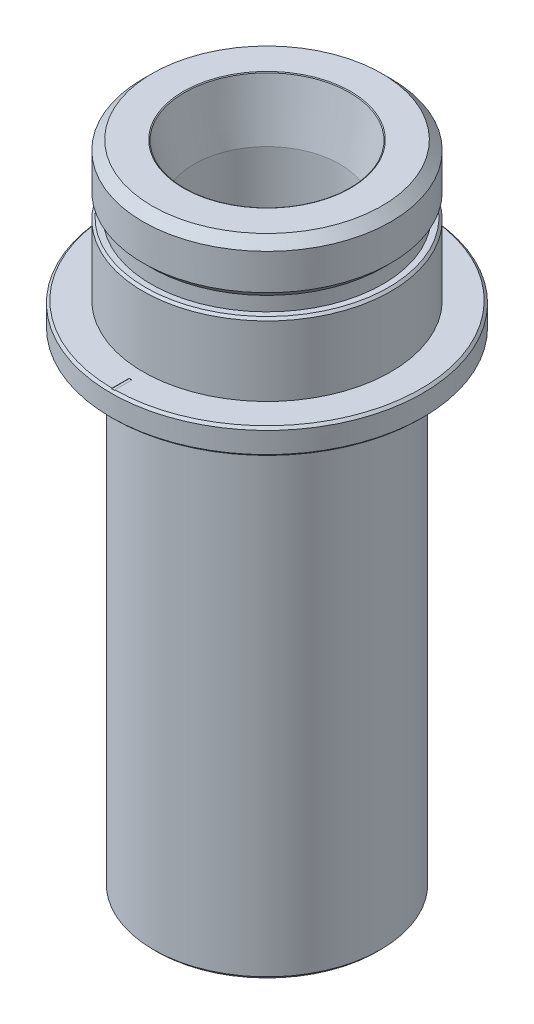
ISO-10303-21;
HEADER;
FILE_DESCRIPTION(('STEP AP214'),'2;1');
FILE_NAME('part.step','',(''),(''),'','','');
FILE_SCHEMA(('AUTOMOTIVE_DESIGN { 1 0 10303 214 1 1 1 1 }'));
ENDSEC;
DATA;
#1=APPLICATION_CONTEXT('core data for automotive mechanical design processes');
#2=APPLICATION_PROTOCOL_DEFINITION('international standard','automotive_design',2000,#1);
#3=PRODUCT_CONTEXT('',#1,'mechanical');
#4=PRODUCT('Part','Part','',(#3));
#5=PRODUCT_RELATED_PRODUCT_CATEGORY('part','',(#4));
#6=PRODUCT_DEFINITION_FORMATION('','',#4);
#7=PRODUCT_DEFINITION_CONTEXT('part definition',#1,'design');
#8=PRODUCT_DEFINITION('design','',#6,#7);
#9=PRODUCT_DEFINITION_SHAPE('','',#8);
#10=(LENGTH_UNIT() NAMED_UNIT(*) SI_UNIT(.MILLI.,.METRE.));
#11=(NAMED_UNIT(*) PLANE_ANGLE_UNIT() SI_UNIT($,.RADIAN.));
#12=(NAMED_UNIT(*) SI_UNIT($,.STERADIAN.) SOLID_ANGLE_UNIT());
#13=UNCERTAINTY_MEASURE_WITH_UNIT(LENGTH_MEASURE(1.E-05),#10,'distance_accuracy_value','');
#14=(GEOMETRIC_REPRESENTATION_CONTEXT(3) GLOBAL_UNCERTAINTY_ASSIGNED_CONTEXT((#13)) GLOBAL_UNIT_ASSIGNED_CONTEXT((#10,
#11,#12)) REPRESENTATION_CONTEXT('',''));
#15=CARTESIAN_POINT('',(0.,0.,0.));
#16=DIRECTION('',(0.,0.,1.));
#17=DIRECTION('',(1.,0.,0.));
#18=AXIS2_PLACEMENT_3D('',#15,#16,#17);
#19=CARTESIAN_POINT('',(-0.0234141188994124,80.5713399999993,-152.4));
#20=DIRECTION('',(0.,1.,0.));
#21=DIRECTION('',(0.,0.,1.));
#22=AXIS2_PLACEMENT_3D('',#19,#20,#21);
#23=CONICAL_SURFACE('',#22,27.6859999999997,0.785398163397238);
#24=CARTESIAN_POINT('',(-0.0234141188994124,80.5713399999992,-152.4));
#25=DIRECTION('',(0.,-1.,0.));
#26=DIRECTION('',(0.,0.,-1.));
#27=AXIS2_PLACEMENT_3D('',#24,#25,#26);
#28=CIRCLE('',#27,27.6859999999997);
#29=CARTESIAN_POINT('',(-0.0234141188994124,80.5713399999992,-180.086));
#30=VERTEX_POINT('',#29);
#31=EDGE_CURVE('E91',#30,#30,#28,.F.);
#32=ORIENTED_EDGE('',*,*,#31,.F.);
#33=EDGE_LOOP('',(#32));
#34=FACE_BOUND('',#33,.T.);
#35=CARTESIAN_POINT('',(-0.0234141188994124,78.7933399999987,-152.4));
#36=DIRECTION('',(0.,-1.,0.));
#37=DIRECTION('',(0.,0.,-1.));
#38=AXIS2_PLACEMENT_3D('',#35,#36,#37);
#39=CIRCLE('',#38,25.908);
#40=CARTESIAN_POINT('',(-0.0234141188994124,78.7933399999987,-178.308));
#41=VERTEX_POINT('',#40);
#42=EDGE_CURVE('E94',#41,#41,#39,.T.);
#43=ORIENTED_EDGE('',*,*,#42,.F.);
#44=EDGE_LOOP('',(#43));
#45=FACE_BOUND('',#44,.T.);
#46=ADVANCED_FACE('F17',(#34,#45),#23,.T.);
#47=CARTESIAN_POINT('',(-0.0234141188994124,77.2058399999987,-152.4));
#48=DIRECTION('',(0.,-1.,0.));
#49=DIRECTION('',(0.,0.,-1.));
#50=AXIS2_PLACEMENT_3D('',#47,#48,#49);
#51=CYLINDRICAL_SURFACE('',#50,25.908);
#52=ORIENTED_EDGE('',*,*,#42,.T.);
#53=EDGE_LOOP('',(#52));
#54=FACE_BOUND('',#53,.T.);
#55=CARTESIAN_POINT('',(-0.0234141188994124,75.6183399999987,-152.4));
#56=DIRECTION('',(0.,-1.,0.));
#57=DIRECTION('',(0.,0.,-1.));
#58=AXIS2_PLACEMENT_3D('',#55,#56,#57);
#59=CIRCLE('',#58,25.908);
#60=CARTESIAN_POINT('',(-0.0234141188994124,75.6183399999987,-178.308));
#61=VERTEX_POINT('',#60);
#62=EDGE_CURVE('E20',#61,#61,#59,.T.);
#63=ORIENTED_EDGE('',*,*,#62,.F.);
#64=EDGE_LOOP('',(#63));
#65=FACE_BOUND('',#64,.T.);
#66=ADVANCED_FACE('F137',(#54,#65),#51,.T.);
#67=CARTESIAN_POINT('',(-0.0234141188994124,84.5718399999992,-152.4));
#68=DIRECTION('',(0.,-1.,0.));
#69=DIRECTION('',(0.,0.,-1.));
#70=AXIS2_PLACEMENT_3D('',#67,#68,#69);
#71=CYLINDRICAL_SURFACE('',#70,27.6859999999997);
#72=CARTESIAN_POINT('',(-0.0234141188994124,88.5723399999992,-152.4));
#73=DIRECTION('',(0.,-1.,0.));
#74=DIRECTION('',(0.,0.,1.));
#75=AXIS2_PLACEMENT_3D('',#72,#73,#74);
#76=CIRCLE('',#75,27.6859999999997);
#77=CARTESIAN_POINT('',(-0.0234141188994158,88.5723399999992,-124.714));
#78=VERTEX_POINT('',#77);
#79=EDGE_CURVE('E61',#78,#78,#76,.F.);
#80=ORIENTED_EDGE('',*,*,#79,.F.);
#81=EDGE_LOOP('',(#80));
#82=FACE_BOUND('',#81,.T.);
#83=ORIENTED_EDGE('',*,*,#31,.T.);
#84=EDGE_LOOP('',(#83));
#85=FACE_BOUND('',#84,.T.);
#86=ADVANCED_FACE('F127',(#82,#85),#71,.T.);
#87=CARTESIAN_POINT('',(-0.0234141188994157,75.6183399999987,-125.222));
#88=DIRECTION('',(0.,1.,0.));
#89=DIRECTION('',(0.,0.,1.));
#90=AXIS2_PLACEMENT_3D('',#87,#88,#89);
#91=PLANE('',#90);
#92=ORIENTED_EDGE('',*,*,#62,.T.);
#93=EDGE_LOOP('',(#92));
#94=FACE_BOUND('',#93,.T.);
#95=CARTESIAN_POINT('',(-0.0234141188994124,75.6183399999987,-152.4));
#96=DIRECTION('',(0.,-1.,0.));
#97=DIRECTION('',(0.,0.,-1.));
#98=AXIS2_PLACEMENT_3D('',#95,#96,#97);
#99=CIRCLE('',#98,27.1779999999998);
#100=CARTESIAN_POINT('',(-0.0234141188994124,75.6183399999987,-179.578));
#101=VERTEX_POINT('',#100);
#102=EDGE_CURVE('E60',#101,#101,#99,.T.);
#103=ORIENTED_EDGE('',*,*,#102,.F.);
#104=EDGE_LOOP('',(#103));
#105=FACE_BOUND('',#104,.T.);
#106=ADVANCED_FACE('F124',(#94,#105),#91,.T.);
#107=CARTESIAN_POINT('',(-0.0234141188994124,88.5723399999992,-152.4));
#108=DIRECTION('',(0.,-1.,0.));
#109=DIRECTION('',(0.,0.,-1.));
#110=AXIS2_PLACEMENT_3D('',#107,#108,#109);
#111=CONICAL_SURFACE('',#110,27.6859999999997,0.785398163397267);
#112=CARTESIAN_POINT('',(-0.0234141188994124,90.6040707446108,-152.4));
#113=DIRECTION('',(0.,-1.,0.));
#114=DIRECTION('',(0.,0.,1.));
#115=AXIS2_PLACEMENT_3D('',#112,#113,#114);
#116=CIRCLE('',#115,25.654269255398);
#117=CARTESIAN_POINT('',(-0.0234141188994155,90.6040707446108,-126.745730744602));
#118=VERTEX_POINT('',#117);
#119=EDGE_CURVE('E67',#118,#118,#116,.F.);
#120=ORIENTED_EDGE('',*,*,#119,.F.);
#121=EDGE_LOOP('',(#120));
#122=FACE_BOUND('',#121,.T.);
#123=ORIENTED_EDGE('',*,*,#79,.T.);
#124=EDGE_LOOP('',(#123));
#125=FACE_BOUND('',#124,.T.);
#126=ADVANCED_FACE('F126',(#122,#125),#111,.T.);
#127=CARTESIAN_POINT('',(-0.0234141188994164,59.4512399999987,-119.822301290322));
#128=DIRECTION('',(0.,-1.,0.));
#129=DIRECTION('',(0.,0.,-1.));
#130=AXIS2_PLACEMENT_3D('',#127,#128,#129);
#131=PLANE('',#130);
#132=DIRECTION('',(0.,0.,-1.));
#133=VECTOR('',#132,1.);
#134=CARTESIAN_POINT('',(0.294085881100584,59.4512399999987,-121.92));
#135=LINE('',#134,#133);
#136=CARTESIAN_POINT('',(0.294085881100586,59.4512399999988,-118.00986559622));
#137=VERTEX_POINT('',#136);
#138=CARTESIAN_POINT('',(0.294085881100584,59.4512399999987,-121.92));
#139=VERTEX_POINT('',#138);
#140=EDGE_CURVE('E82',#137,#139,#135,.T.);
#141=ORIENTED_EDGE('',*,*,#140,.T.);
#142=DIRECTION('',(-1.,0.,0.));
#143=VECTOR('',#142,1.);
#144=CARTESIAN_POINT('',(-0.340914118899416,59.4512399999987,-121.92));
#145=LINE('',#144,#143);
#146=CARTESIAN_POINT('',(-0.340914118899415,59.4512399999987,-121.92));
#147=VERTEX_POINT('',#146);
#148=EDGE_CURVE('E53',#139,#147,#145,.T.);
#149=ORIENTED_EDGE('',*,*,#148,.T.);
#150=DIRECTION('',(0.,0.,1.));
#151=VECTOR('',#150,1.);
#152=CARTESIAN_POINT('',(-0.340914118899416,59.4512399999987,-117.724602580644));
#153=LINE('',#152,#151);
#154=CARTESIAN_POINT('',(-0.34091411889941,59.4512399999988,-118.00986559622));
#155=VERTEX_POINT('',#154);
#156=EDGE_CURVE('E62',#147,#155,#153,.T.);
#157=ORIENTED_EDGE('',*,*,#156,.T.);
#158=CARTESIAN_POINT('',(-0.0234141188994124,59.4512399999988,-152.4));
#159=DIRECTION('',(0.,-1.,0.));
#160=DIRECTION('',(0.,0.,-1.));
#161=AXIS2_PLACEMENT_3D('',#158,#159,#160);
#162=CIRCLE('',#161,34.3916000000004);
#163=EDGE_CURVE('E48',#137,#155,#162,.T.);
#164=ORIENTED_EDGE('',*,*,#163,.F.);
#165=EDGE_LOOP('',(#141,#149,#157,#164));
#166=FACE_BOUND('',#165,.T.);
#167=ADVANCED_FACE('F63',(#166),#131,.F.);
#168=CARTESIAN_POINT('',(-0.0234141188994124,75.1103399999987,-152.4));
#169=DIRECTION('',(0.,-1.,0.));
#170=DIRECTION('',(0.,0.,-1.));
#171=AXIS2_PLACEMENT_3D('',#168,#169,#170);
#172=CONICAL_SURFACE('',#171,27.6859999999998,0.785398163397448);
#173=ORIENTED_EDGE('',*,*,#102,.T.);
#174=EDGE_LOOP('',(#173));
#175=FACE_BOUND('',#174,.T.);
#176=CARTESIAN_POINT('',(-0.0234141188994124,75.1103399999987,-152.4));
#177=DIRECTION('',(0.,-1.,0.));
#178=DIRECTION('',(0.,0.,-1.));
#179=AXIS2_PLACEMENT_3D('',#176,#177,#178);
#180=CIRCLE('',#179,27.6859999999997);
#181=CARTESIAN_POINT('',(-0.0234141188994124,75.1103399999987,-180.086));
#182=VERTEX_POINT('',#181);
#183=EDGE_CURVE('E366',#182,#182,#180,.T.);
#184=ORIENTED_EDGE('',*,*,#183,.F.);
#185=EDGE_LOOP('',(#184));
#186=FACE_BOUND('',#185,.T.);
#187=ADVANCED_FACE('F121',(#175,#186),#172,.T.);
#188=CARTESIAN_POINT('',(-0.0234141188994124,90.6040707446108,-152.4));
#189=DIRECTION('',(0.,-1.,0.));
#190=DIRECTION('',(0.,0.,-1.));
#191=AXIS2_PLACEMENT_3D('',#188,#189,#190);
#192=CONICAL_SURFACE('',#191,25.654269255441,1.57075620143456);
#193=CARTESIAN_POINT('',(-0.0234141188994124,90.604349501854,-152.4));
#194=DIRECTION('',(0.,1.,0.));
#195=DIRECTION('',(0.,0.,1.));
#196=AXIS2_PLACEMENT_3D('',#193,#194,#195);
#197=CIRCLE('',#196,18.7071108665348);
#198=CARTESIAN_POINT('',(-0.0234141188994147,90.604349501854,-133.692889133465));
#199=VERTEX_POINT('',#198);
#200=EDGE_CURVE('E362',#199,#199,#197,.F.);
#201=ORIENTED_EDGE('',*,*,#200,.T.);
#202=EDGE_LOOP('',(#201));
#203=FACE_BOUND('',#202,.T.);
#204=ORIENTED_EDGE('',*,*,#119,.T.);
#205=EDGE_LOOP('',(#204));
#206=FACE_BOUND('',#205,.T.);
#207=ADVANCED_FACE('F201',(#203,#206),#192,.T.);
#208=CARTESIAN_POINT('',(-0.340914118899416,59.5274399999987,-117.724602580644));
#209=DIRECTION('',(-1.,0.,0.));
#210=DIRECTION('',(0.,0.,1.));
#211=AXIS2_PLACEMENT_3D('',#208,#209,#210);
#212=PLANE('',#211);
#213=ORIENTED_EDGE('',*,*,#156,.F.);
#214=DIRECTION('',(0.,1.,0.));
#215=VECTOR('',#214,1.);
#216=CARTESIAN_POINT('',(-0.340914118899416,59.5274399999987,-121.92));
#217=LINE('',#216,#215);
#218=CARTESIAN_POINT('',(-0.340914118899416,59.5274399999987,-121.92));
#219=VERTEX_POINT('',#218);
#220=EDGE_CURVE('E74',#147,#219,#217,.T.);
#221=ORIENTED_EDGE('',*,*,#220,.T.);
#222=DIRECTION('',(0.,0.,1.));
#223=VECTOR('',#222,1.);
#224=CARTESIAN_POINT('',(-0.340914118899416,59.5274399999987,-118.084599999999));
#225=LINE('',#224,#223);
#226=CARTESIAN_POINT('',(-0.340914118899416,59.5274399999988,-118.086068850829));
#227=VERTEX_POINT('',#226);
#228=EDGE_CURVE('E71',#227,#219,#225,.F.);
#229=ORIENTED_EDGE('',*,*,#228,.F.);
#230=DIRECTION('',(0.,0.707091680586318,-0.707121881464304));
#231=VECTOR('',#230,1.);
#232=CARTESIAN_POINT('',(-0.340914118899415,59.4512399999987,-118.00986559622));
#233=LINE('',#232,#231);
#234=EDGE_CURVE('E35',#155,#227,#233,.T.);
#235=ORIENTED_EDGE('',*,*,#234,.F.);
#236=EDGE_LOOP('',(#213,#221,#229,#235));
#237=FACE_BOUND('',#236,.T.);
#238=ADVANCED_FACE('F69',(#237),#212,.F.);
#239=CARTESIAN_POINT('',(-0.340914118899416,59.5274399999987,-121.92));
#240=DIRECTION('',(0.,0.,-1.));
#241=DIRECTION('',(-1.,0.,0.));
#242=AXIS2_PLACEMENT_3D('',#239,#240,#241);
#243=PLANE('',#242);
#244=ORIENTED_EDGE('',*,*,#220,.F.);
#245=ORIENTED_EDGE('',*,*,#148,.F.);
#246=DIRECTION('',(0.,1.,0.));
#247=VECTOR('',#246,1.);
#248=CARTESIAN_POINT('',(0.294085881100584,59.5274399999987,-121.92));
#249=LINE('',#248,#247);
#250=CARTESIAN_POINT('',(0.294085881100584,59.5274399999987,-121.92));
#251=VERTEX_POINT('',#250);
#252=EDGE_CURVE('E84',#139,#251,#249,.T.);
#253=ORIENTED_EDGE('',*,*,#252,.T.);
#254=DIRECTION('',(1.,0.,0.));
#255=VECTOR('',#254,1.);
#256=CARTESIAN_POINT('',(-0.0234141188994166,59.5274399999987,-121.92));
#257=LINE('',#256,#255);
#258=EDGE_CURVE('E368',#219,#251,#257,.T.);
#259=ORIENTED_EDGE('',*,*,#258,.F.);
#260=EDGE_LOOP('',(#244,#245,#253,#259));
#261=FACE_BOUND('',#260,.T.);
#262=ADVANCED_FACE('F194',(#261),#243,.F.);
#263=CARTESIAN_POINT('',(0.294085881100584,59.5274399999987,-121.92));
#264=DIRECTION('',(1.,0.,0.));
#265=DIRECTION('',(0.,0.,-1.));
#266=AXIS2_PLACEMENT_3D('',#263,#264,#265);
#267=PLANE('',#266);
#268=DIRECTION('',(0.,0.,1.));
#269=VECTOR('',#268,1.);
#270=CARTESIAN_POINT('',(0.294085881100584,59.5274399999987,-118.084599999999));
#271=LINE('',#270,#269);
#272=CARTESIAN_POINT('',(0.294085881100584,59.5274399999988,-118.08606885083));
#273=VERTEX_POINT('',#272);
#274=EDGE_CURVE('E117',#251,#273,#271,.T.);
#275=ORIENTED_EDGE('',*,*,#274,.F.);
#276=ORIENTED_EDGE('',*,*,#252,.F.);
#277=ORIENTED_EDGE('',*,*,#140,.F.);
#278=DIRECTION('',(0.,-0.707091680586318,0.707121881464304));
#279=VECTOR('',#278,1.);
#280=CARTESIAN_POINT('',(0.294085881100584,59.5274399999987,-118.086068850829));
#281=LINE('',#280,#279);
#282=EDGE_CURVE('E58',#273,#137,#281,.T.);
#283=ORIENTED_EDGE('',*,*,#282,.F.);
#284=EDGE_LOOP('',(#275,#276,#277,#283));
#285=FACE_BOUND('',#284,.T.);
#286=ADVANCED_FACE('F190',(#285),#267,.F.);
#287=CARTESIAN_POINT('',(-0.0234141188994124,67.3188899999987,-152.4));
#288=DIRECTION('',(0.,-1.,0.));
#289=DIRECTION('',(0.,0.,-1.));
#290=AXIS2_PLACEMENT_3D('',#287,#288,#289);
#291=CYLINDRICAL_SURFACE('',#290,27.6859999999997);
#292=ORIENTED_EDGE('',*,*,#183,.T.);
#293=EDGE_LOOP('',(#292));
#294=FACE_BOUND('',#293,.T.);
#295=CARTESIAN_POINT('',(-0.0234141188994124,59.5274399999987,-152.4));
#296=DIRECTION('',(0.,-1.,0.));
#297=DIRECTION('',(0.,0.,-1.));
#298=AXIS2_PLACEMENT_3D('',#295,#296,#297);
#299=CIRCLE('',#298,27.6859999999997);
#300=CARTESIAN_POINT('',(-0.0234141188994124,59.5274399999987,-180.086));
#301=VERTEX_POINT('',#300);
#302=EDGE_CURVE('E114',#301,#301,#299,.T.);
#303=ORIENTED_EDGE('',*,*,#302,.F.);
#304=EDGE_LOOP('',(#303));
#305=FACE_BOUND('',#304,.T.);
#306=ADVANCED_FACE('F186',(#294,#305),#291,.T.);
#307=CARTESIAN_POINT('',(-0.0234141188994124,90.604349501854,-152.4));
#308=DIRECTION('',(0.,1.,0.));
#309=DIRECTION('',(0.,0.,1.));
#310=AXIS2_PLACEMENT_3D('',#307,#308,#309);
#311=CONICAL_SURFACE('',#310,18.7071108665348,1.04719755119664);
#312=ORIENTED_EDGE('',*,*,#200,.F.);
#313=EDGE_LOOP('',(#312));
#314=FACE_BOUND('',#313,.T.);
#315=CARTESIAN_POINT('',(-0.0234141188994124,90.4818953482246,-152.4));
#316=DIRECTION('',(0.,1.,0.));
#317=DIRECTION('',(0.,0.,1.));
#318=AXIS2_PLACEMENT_3D('',#315,#316,#317);
#319=CIRCLE('',#318,18.4950140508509);
#320=CARTESIAN_POINT('',(-0.0234141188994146,90.4818953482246,-133.904985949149));
#321=VERTEX_POINT('',#320);
#322=EDGE_CURVE('E113',#321,#321,#319,.F.);
#323=ORIENTED_EDGE('',*,*,#322,.T.);
#324=EDGE_LOOP('',(#323));
#325=FACE_BOUND('',#324,.T.);
#326=ADVANCED_FACE('F182',(#314,#325),#311,.F.);
#327=CARTESIAN_POINT('',(-0.0234141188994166,59.5274399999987,-118.084599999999));
#328=DIRECTION('',(0.,1.,0.));
#329=DIRECTION('',(0.,0.,1.));
#330=AXIS2_PLACEMENT_3D('',#327,#328,#329);
#331=PLANE('',#330);
#332=ORIENTED_EDGE('',*,*,#302,.T.);
#333=EDGE_LOOP('',(#332));
#334=FACE_BOUND('',#333,.T.);
#335=ORIENTED_EDGE('',*,*,#274,.T.);
#336=CARTESIAN_POINT('',(-0.0234141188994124,59.5274399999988,-152.4));
#337=DIRECTION('',(0.,-1.,0.));
#338=DIRECTION('',(0.,0.,-1.));
#339=AXIS2_PLACEMENT_3D('',#336,#337,#338);
#340=CIRCLE('',#339,34.3154000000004);
#341=EDGE_CURVE('E110',#227,#273,#340,.T.);
#342=ORIENTED_EDGE('',*,*,#341,.F.);
#343=ORIENTED_EDGE('',*,*,#228,.T.);
#344=ORIENTED_EDGE('',*,*,#258,.T.);
#345=EDGE_LOOP('',(#335,#342,#343,#344));
#346=FACE_BOUND('',#345,.T.);
#347=ADVANCED_FACE('F178',(#334,#346),#331,.T.);
#348=CARTESIAN_POINT('',(-0.0234141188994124,90.4818953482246,-152.4));
#349=DIRECTION('',(0.,1.,0.));
#350=DIRECTION('',(-1.,0.,0.));
#351=AXIS2_PLACEMENT_3D('',#348,#349,#350);
#352=CONICAL_SURFACE('',#351,18.4950140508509,0.174560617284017);
#353=ORIENTED_EDGE('',*,*,#322,.F.);
#354=EDGE_LOOP('',(#353));
#355=FACE_BOUND('',#354,.T.);
#356=CARTESIAN_POINT('',(-0.0234141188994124,77.7858715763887,-152.4));
#357=DIRECTION('',(0.,-1.,0.));
#358=DIRECTION('',(0.,0.,-1.));
#359=AXIS2_PLACEMENT_3D('',#356,#357,#358);
#360=CIRCLE('',#359,16.256);
#361=CARTESIAN_POINT('',(-0.0234141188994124,77.7858715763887,-168.656));
#362=VERTEX_POINT('',#361);
#363=EDGE_CURVE('E112',#362,#362,#360,.T.);
#364=ORIENTED_EDGE('',*,*,#363,.T.);
#365=EDGE_LOOP('',(#364));
#366=FACE_BOUND('',#365,.T.);
#367=ADVANCED_FACE('F175',(#355,#366),#352,.F.);
#368=CARTESIAN_POINT('',(-0.0234141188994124,58.9940399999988,-152.4));
#369=DIRECTION('',(0.,-1.,0.));
#370=DIRECTION('',(0.,0.,-1.));
#371=AXIS2_PLACEMENT_3D('',#368,#369,#370);
#372=CONICAL_SURFACE('',#371,34.8488000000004,0.785398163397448);
#373=ORIENTED_EDGE('',*,*,#341,.T.);
#374=ORIENTED_EDGE('',*,*,#282,.T.);
#375=ORIENTED_EDGE('',*,*,#163,.T.);
#376=ORIENTED_EDGE('',*,*,#234,.T.);
#377=EDGE_LOOP('',(#373,#374,#375,#376));
#378=FACE_BOUND('',#377,.T.);
#379=CARTESIAN_POINT('',(-0.0234141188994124,58.9940399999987,-152.4));
#380=DIRECTION('',(0.,-1.,0.));
#381=DIRECTION('',(0.,0.,-1.));
#382=AXIS2_PLACEMENT_3D('',#379,#380,#381);
#383=CIRCLE('',#382,34.8488000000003);
#384=CARTESIAN_POINT('',(-0.0234141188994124,58.9940399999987,-187.2488));
#385=VERTEX_POINT('',#384);
#386=EDGE_CURVE('E109',#385,#385,#383,.T.);
#387=ORIENTED_EDGE('',*,*,#386,.F.);
#388=EDGE_LOOP('',(#387));
#389=FACE_BOUND('',#388,.T.);
#390=ADVANCED_FACE('F55',(#378,#389),#372,.T.);
#391=CARTESIAN_POINT('',(-0.0234141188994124,11.8051057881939,-152.4));
#392=DIRECTION('',(0.,-1.,0.));
#393=DIRECTION('',(0.,0.,-1.));
#394=AXIS2_PLACEMENT_3D('',#391,#392,#393);
#395=CYLINDRICAL_SURFACE('',#394,16.256);
#396=ORIENTED_EDGE('',*,*,#363,.F.);
#397=EDGE_LOOP('',(#396));
#398=FACE_BOUND('',#397,.T.);
#399=CARTESIAN_POINT('',(-0.0234141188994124,-54.175660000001,-152.4));
#400=DIRECTION('',(0.,-1.,0.));
#401=DIRECTION('',(0.,0.,-1.));
#402=AXIS2_PLACEMENT_3D('',#399,#400,#401);
#403=CIRCLE('',#402,16.256);
#404=CARTESIAN_POINT('',(-0.0234141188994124,-54.175660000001,-168.656));
#405=VERTEX_POINT('',#404);
#406=EDGE_CURVE('E106',#405,#405,#403,.F.);
#407=ORIENTED_EDGE('',*,*,#406,.F.);
#408=EDGE_LOOP('',(#407));
#409=FACE_BOUND('',#408,.T.);
#410=ADVANCED_FACE('F168',(#398,#409),#395,.F.);
#411=CARTESIAN_POINT('',(-0.0234141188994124,56.6539715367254,-152.4));
#412=DIRECTION('',(0.,-1.,0.));
#413=DIRECTION('',(0.,0.,-1.));
#414=AXIS2_PLACEMENT_3D('',#411,#412,#413);
#415=CYLINDRICAL_SURFACE('',#414,34.8488000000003);
#416=ORIENTED_EDGE('',*,*,#386,.T.);
#417=EDGE_LOOP('',(#416));
#418=FACE_BOUND('',#417,.T.);
#419=CARTESIAN_POINT('',(-0.0234141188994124,54.3139030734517,-152.4));
#420=DIRECTION('',(0.,1.,0.));
#421=DIRECTION('',(0.,0.,1.));
#422=AXIS2_PLACEMENT_3D('',#419,#420,#421);
#423=CIRCLE('',#422,34.8488000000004);
#424=CARTESIAN_POINT('',(-0.0234141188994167,54.3139030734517,-117.5512));
#425=VERTEX_POINT('',#424);
#426=EDGE_CURVE('E105',#425,#425,#423,.F.);
#427=ORIENTED_EDGE('',*,*,#426,.F.);
#428=EDGE_LOOP('',(#427));
#429=FACE_BOUND('',#428,.T.);
#430=ADVANCED_FACE('F164',(#418,#429),#415,.T.);
#431=CARTESIAN_POINT('',(-0.0234141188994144,-54.175660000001,-136.144));
#432=DIRECTION('',(0.,-1.,0.));
#433=DIRECTION('',(0.,0.,-1.));
#434=AXIS2_PLACEMENT_3D('',#431,#432,#433);
#435=PLANE('',#434);
#436=ORIENTED_EDGE('',*,*,#406,.T.);
#437=EDGE_LOOP('',(#436));
#438=FACE_BOUND('',#437,.T.);
#439=CARTESIAN_POINT('',(-0.0234141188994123,-54.1756600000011,-152.4));
#440=DIRECTION('',(0.,1.,0.));
#441=DIRECTION('',(-1.,0.,0.));
#442=AXIS2_PLACEMENT_3D('',#439,#440,#441);
#443=CIRCLE('',#442,24.6380000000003);
#444=CARTESIAN_POINT('',(-24.6614141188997,-54.1756600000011,-152.4));
#445=VERTEX_POINT('',#444);
#446=EDGE_CURVE('E102',#445,#445,#443,.T.);
#447=ORIENTED_EDGE('',*,*,#446,.F.);
#448=EDGE_LOOP('',(#447));
#449=FACE_BOUND('',#448,.T.);
#450=ADVANCED_FACE('F160',(#438,#449),#435,.T.);
#451=CARTESIAN_POINT('',(-0.0234141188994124,54.3139030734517,-152.4));
#452=DIRECTION('',(0.,1.,0.));
#453=DIRECTION('',(0.,0.,1.));
#454=AXIS2_PLACEMENT_3D('',#451,#452,#453);
#455=CONICAL_SURFACE('',#454,34.8488000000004,0.785398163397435);
#456=ORIENTED_EDGE('',*,*,#426,.T.);
#457=EDGE_LOOP('',(#456));
#458=FACE_BOUND('',#457,.T.);
#459=CARTESIAN_POINT('',(-0.0234141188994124,53.774339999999,-152.4));
#460=DIRECTION('',(0.,1.,0.));
#461=DIRECTION('',(0.,0.,1.));
#462=AXIS2_PLACEMENT_3D('',#459,#460,#461);
#463=CIRCLE('',#462,34.3092369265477);
#464=CARTESIAN_POINT('',(-0.0234141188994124,53.774339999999,-118.090763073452));
#465=VERTEX_POINT('',#464);
#466=EDGE_CURVE('E99',#465,#465,#463,.F.);
#467=ORIENTED_EDGE('',*,*,#466,.F.);
#468=EDGE_LOOP('',(#467));
#469=FACE_BOUND('',#468,.T.);
#470=ADVANCED_FACE('F156',(#458,#469),#455,.T.);
#471=CARTESIAN_POINT('',(-0.0234141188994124,-53.4136600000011,-152.4));
#472=DIRECTION('',(0.,1.,0.));
#473=DIRECTION('',(-1.,0.,0.));
#474=AXIS2_PLACEMENT_3D('',#471,#472,#473);
#475=CONICAL_SURFACE('',#474,25.4000000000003,0.785398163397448);
#476=CARTESIAN_POINT('',(-0.0234141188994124,-53.413660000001,-152.4));
#477=DIRECTION('',(0.,-1.,0.));
#478=DIRECTION('',(0.,0.,-1.));
#479=AXIS2_PLACEMENT_3D('',#476,#477,#478);
#480=CIRCLE('',#479,25.4000000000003);
#481=CARTESIAN_POINT('',(-0.0234141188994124,-53.413660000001,-177.8));
#482=VERTEX_POINT('',#481);
#483=EDGE_CURVE('E26',#482,#482,#480,.F.);
#484=ORIENTED_EDGE('',*,*,#483,.F.);
#485=EDGE_LOOP('',(#484));
#486=FACE_BOUND('',#485,.T.);
#487=ORIENTED_EDGE('',*,*,#446,.T.);
#488=EDGE_LOOP('',(#487));
#489=FACE_BOUND('',#488,.T.);
#490=ADVANCED_FACE('F149',(#486,#489),#475,.T.);
#491=CARTESIAN_POINT('',(-0.0234141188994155,53.774339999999,-126.999999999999));
#492=DIRECTION('',(0.,-1.,0.));
#493=DIRECTION('',(0.,0.,-1.));
#494=AXIS2_PLACEMENT_3D('',#491,#492,#493);
#495=PLANE('',#494);
#496=CARTESIAN_POINT('',(-0.0234141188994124,53.774339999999,-152.4));
#497=DIRECTION('',(0.,-1.,0.));
#498=DIRECTION('',(0.,0.,-1.));
#499=AXIS2_PLACEMENT_3D('',#496,#497,#498);
#500=CIRCLE('',#499,25.4000000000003);
#501=CARTESIAN_POINT('',(-0.0234141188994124,53.774339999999,-177.8));
#502=VERTEX_POINT('',#501);
#503=EDGE_CURVE('E11',#502,#502,#500,.T.);
#504=ORIENTED_EDGE('',*,*,#503,.F.);
#505=EDGE_LOOP('',(#504));
#506=FACE_BOUND('',#505,.T.);
#507=ORIENTED_EDGE('',*,*,#466,.T.);
#508=EDGE_LOOP('',(#507));
#509=FACE_BOUND('',#508,.T.);
#510=ADVANCED_FACE('F143',(#506,#509),#495,.T.);
#511=CARTESIAN_POINT('',(-0.0234141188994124,0.180339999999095,-152.4));
#512=DIRECTION('',(0.,-1.,0.));
#513=DIRECTION('',(0.,0.,-1.));
#514=AXIS2_PLACEMENT_3D('',#511,#512,#513);
#515=CYLINDRICAL_SURFACE('',#514,25.4000000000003);
#516=ORIENTED_EDGE('',*,*,#503,.T.);
#517=EDGE_LOOP('',(#516));
#518=FACE_BOUND('',#517,.T.);
#519=ORIENTED_EDGE('',*,*,#483,.T.);
#520=EDGE_LOOP('',(#519));
#521=FACE_BOUND('',#520,.T.);
#522=ADVANCED_FACE('F141',(#518,#521),#515,.T.);
#523=CLOSED_SHELL('',(#46,#66,#86,#106,#126,#167,#187,#207,#238,#262,#286,#306,#326,#347,#367,
#390,#410,#430,#450,#470,#490,#510,#522));
#524=MANIFOLD_SOLID_BREP('B1',#523);
#525=ADVANCED_BREP_SHAPE_REPRESENTATION('',(#18,#524),#14);
#526=SHAPE_DEFINITION_REPRESENTATION(#9,#525);
ENDSEC;
END-ISO-10303-21;
